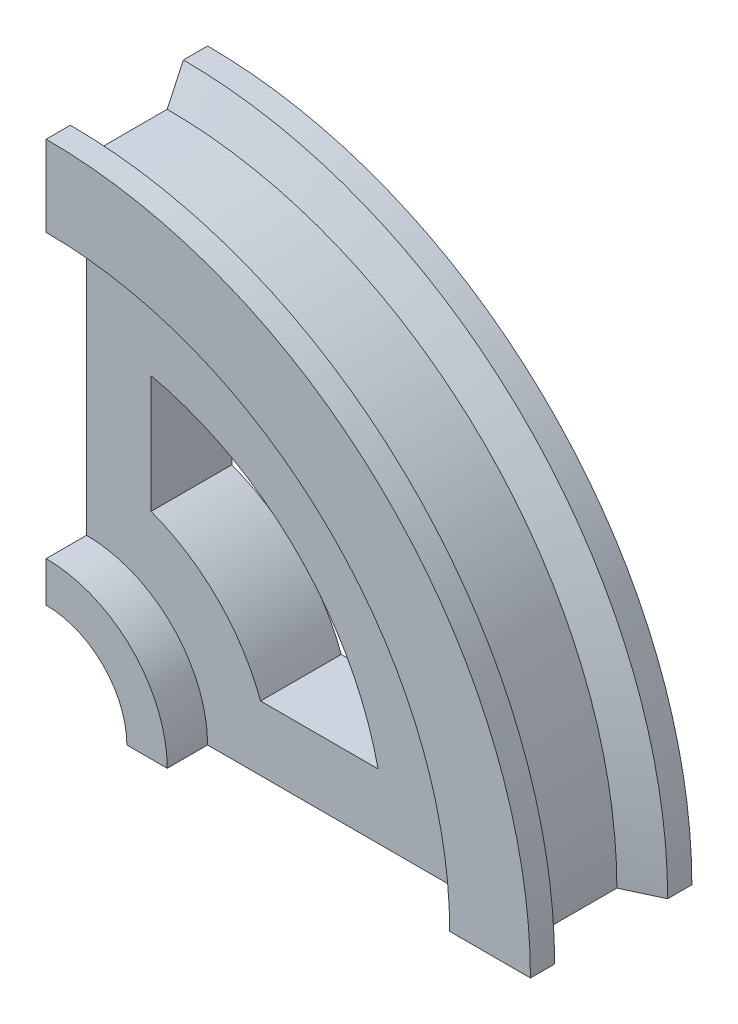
from build123d import *

# Parameters (mm, degrees)
REVOLVE1_ANGLE     = 90
CUT_EXTRUDE1_DEPTH = 10


with BuildPart() as part:
    # Sketch1 → Revolve1 (revolve)
    with BuildSketch(Plane(origin=(0, 0, 0), x_dir=(0, 0, -1), z_dir=(1, 0, 0))):
        Polygon((-5, 15), (-5, 45), (-10, 50), (-10, 60), (-7, 60), (-5, 55.710986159), (5, 55.710986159), (7, 60), (10, 60), (10, 50), (5, 45), (5, 15), (10, 15), (10, 10), (-10, 10), (-10, 15), align=None)
    revolve(axis=Axis((0, 0, 25.740314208), (0, 0, -1)), revolution_arc=REVOLVE1_ANGLE)

    # Sketch2 → Cut-Extrude1 (cut)
    with BuildSketch(Plane(origin=(0, 0, -5), x_dir=(-1, 0, 0), z_dir=(0, 0, -1))):
        with BuildLine():
            Line((-36.124783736, 8), (-21.563858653, 8))
            ThreePointArc((-21.563858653, 8), (-16.263455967, 16.263455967), (-8, 21.563858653))
            Line((-8, 21.563858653), (-8, 36.124783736))
            ThreePointArc((-8, 36.124783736), (-26.162950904, 26.162950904), (-36.124783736, 8))
        make_face()
    extrude(amount=-CUT_EXTRUDE1_DEPTH, mode=Mode.SUBTRACT)


solid = part.part
